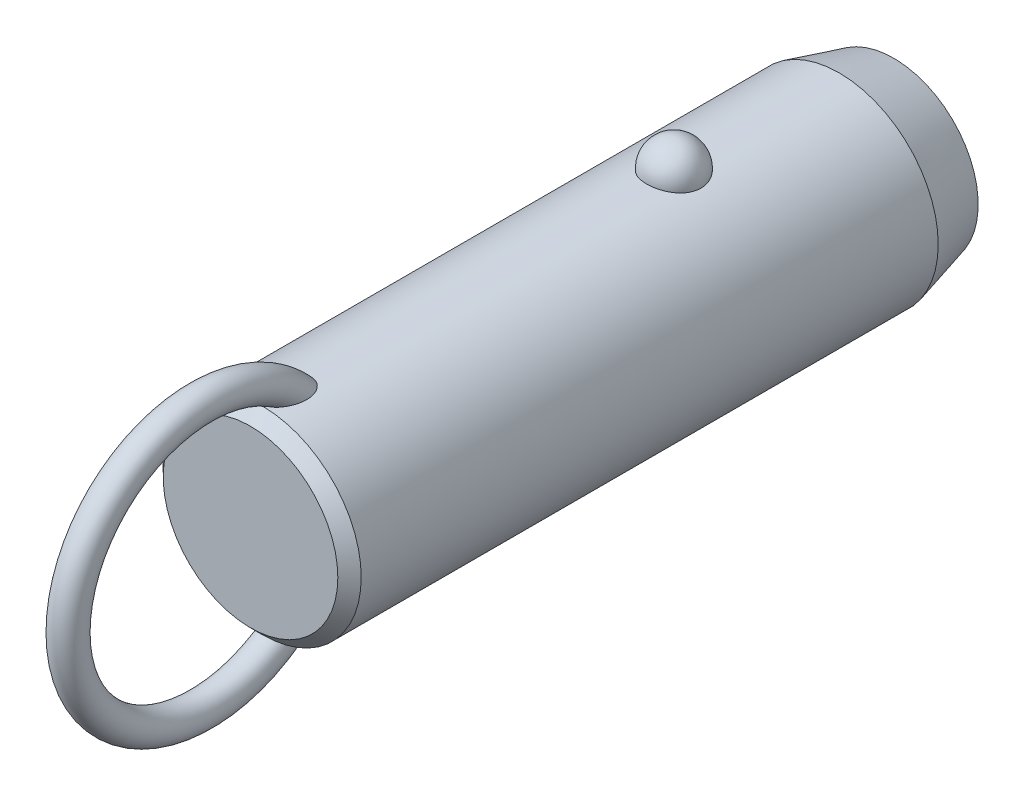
ISO-10303-21;
HEADER;
FILE_DESCRIPTION(('STEP AP214'),'2;1');
FILE_NAME('part.step','',(''),(''),'','','');
FILE_SCHEMA(('AUTOMOTIVE_DESIGN { 1 0 10303 214 1 1 1 1 }'));
ENDSEC;
DATA;
#1=APPLICATION_CONTEXT('core data for automotive mechanical design processes');
#2=APPLICATION_PROTOCOL_DEFINITION('international standard','automotive_design',2000,#1);
#3=PRODUCT_CONTEXT('',#1,'mechanical');
#4=PRODUCT('Part','Part','',(#3));
#5=PRODUCT_RELATED_PRODUCT_CATEGORY('part','',(#4));
#6=PRODUCT_DEFINITION_FORMATION('','',#4);
#7=PRODUCT_DEFINITION_CONTEXT('part definition',#1,'design');
#8=PRODUCT_DEFINITION('design','',#6,#7);
#9=PRODUCT_DEFINITION_SHAPE('','',#8);
#10=(LENGTH_UNIT() NAMED_UNIT(*) SI_UNIT(.MILLI.,.METRE.));
#11=(NAMED_UNIT(*) PLANE_ANGLE_UNIT() SI_UNIT($,.RADIAN.));
#12=(NAMED_UNIT(*) SI_UNIT($,.STERADIAN.) SOLID_ANGLE_UNIT());
#13=UNCERTAINTY_MEASURE_WITH_UNIT(LENGTH_MEASURE(1.E-05),#10,'distance_accuracy_value','');
#14=(GEOMETRIC_REPRESENTATION_CONTEXT(3) GLOBAL_UNCERTAINTY_ASSIGNED_CONTEXT((#13)) GLOBAL_UNIT_ASSIGNED_CONTEXT((#10,
#11,#12)) REPRESENTATION_CONTEXT('',''));
#15=CARTESIAN_POINT('',(0.,0.,0.));
#16=DIRECTION('',(0.,0.,1.));
#17=DIRECTION('',(1.,0.,0.));
#18=AXIS2_PLACEMENT_3D('',#15,#16,#17);
#19=CARTESIAN_POINT('',(0.,0.,38.1));
#20=DIRECTION('',(0.,0.,-1.));
#21=DIRECTION('',(-1.,0.,0.));
#22=AXIS2_PLACEMENT_3D('',#19,#20,#21);
#23=CYLINDRICAL_SURFACE('',#22,12.7);
#24=CARTESIAN_POINT('',(3.46661256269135,12.2177165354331,-3.5));
#25=CARTESIAN_POINT('',(3.4666090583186,12.2177194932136,-3.30432790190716));
#26=CARTESIAN_POINT('',(3.45063567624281,12.2222841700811,-3.10861112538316));
#27=CARTESIAN_POINT('',(3.38712451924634,12.2400345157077,-2.72271899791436));
#28=CARTESIAN_POINT('',(3.33957415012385,12.2532236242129,-2.53254588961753));
#29=CARTESIAN_POINT('',(3.2141234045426,12.286724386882,-2.16324948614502));
#30=CARTESIAN_POINT('',(3.13623639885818,12.3070329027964,-1.98412136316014));
#31=CARTESIAN_POINT('',(2.95205930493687,12.3525018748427,-1.64180592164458));
#32=CARTESIAN_POINT('',(2.84577003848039,12.3776621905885,-1.47861814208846));
#33=CARTESIAN_POINT('',(2.60688050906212,12.4301712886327,-1.17190583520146));
#34=CARTESIAN_POINT('',(2.47415697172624,12.4575299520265,-1.02847897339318));
#35=CARTESIAN_POINT('',(2.18615174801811,12.5112810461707,-0.766177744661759));
#36=CARTESIAN_POINT('',(2.03087002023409,12.5376734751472,-0.647303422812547));
#37=CARTESIAN_POINT('',(1.70237334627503,12.5864761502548,-0.437732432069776));
#38=CARTESIAN_POINT('',(1.52920948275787,12.6088972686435,-0.346958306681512));
#39=CARTESIAN_POINT('',(1.16944170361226,12.6473352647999,-0.195750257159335));
#40=CARTESIAN_POINT('',(0.982839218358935,12.663352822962,-0.135313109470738));
#41=CARTESIAN_POINT('',(0.604961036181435,12.6869706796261,-0.0473241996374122));
#42=CARTESIAN_POINT('',(0.413823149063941,12.6947125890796,-0.0192185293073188));
#43=CARTESIAN_POINT('',(0.0293827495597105,12.7014203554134,0.00517254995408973));
#44=CARTESIAN_POINT('',(-0.163919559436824,12.7003870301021,0.00146092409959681));
#45=CARTESIAN_POINT('',(-0.544374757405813,12.689735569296,-0.037393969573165));
#46=CARTESIAN_POINT('',(-0.731575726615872,12.6802364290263,-0.0721015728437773));
#47=CARTESIAN_POINT('',(-1.09733277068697,12.6538333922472,-0.171364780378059));
#48=CARTESIAN_POINT('',(-1.27588869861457,12.6369293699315,-0.235920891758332));
#49=CARTESIAN_POINT('',(-1.6204698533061,12.5973946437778,-0.39354853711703));
#50=CARTESIAN_POINT('',(-1.78641865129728,12.5747321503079,-0.486778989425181));
#51=CARTESIAN_POINT('',(-2.10030671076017,12.5261316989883,-0.699110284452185));
#52=CARTESIAN_POINT('',(-2.24824419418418,12.5001934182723,-0.81821367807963));
#53=CARTESIAN_POINT('',(-2.52491489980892,12.4472906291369,-1.08157124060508));
#54=CARTESIAN_POINT('',(-2.65324222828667,12.4203160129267,-1.22624992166));
#55=CARTESIAN_POINT('',(-2.88410007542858,12.3687509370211,-1.53528325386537));
#56=CARTESIAN_POINT('',(-2.98662883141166,12.3441606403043,-1.69963924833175));
#57=CARTESIAN_POINT('',(-3.16432417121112,12.2998199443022,-2.04548497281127));
#58=CARTESIAN_POINT('',(-3.23917525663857,12.2801261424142,-2.22714424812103));
#59=CARTESIAN_POINT('',(-3.35800573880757,12.248167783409,-2.6009138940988));
#60=CARTESIAN_POINT('',(-3.4019860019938,12.2359030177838,-2.79302397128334));
#61=CARTESIAN_POINT('',(-3.45784812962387,12.2202347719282,-3.18140279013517));
#62=CARTESIAN_POINT('',(-3.46986123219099,12.2167950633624,-3.37765118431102));
#63=CARTESIAN_POINT('',(-3.46186273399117,12.2190638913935,-3.76943689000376));
#64=CARTESIAN_POINT('',(-3.44185196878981,12.2247721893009,-3.96497421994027));
#65=CARTESIAN_POINT('',(-3.37048652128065,12.2446381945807,-4.34881728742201));
#66=CARTESIAN_POINT('',(-3.31928253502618,12.2587552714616,-4.53715319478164));
#67=CARTESIAN_POINT('',(-3.18693461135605,12.2938237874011,-4.90231727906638));
#68=CARTESIAN_POINT('',(-3.1057895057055,12.3147754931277,-5.07914500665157));
#69=CARTESIAN_POINT('',(-2.91506431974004,12.3613125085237,-5.41732059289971));
#70=CARTESIAN_POINT('',(-2.80533587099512,12.3869217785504,-5.57858147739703));
#71=CARTESIAN_POINT('',(-2.560414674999,12.4398525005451,-5.88013283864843));
#72=CARTESIAN_POINT('',(-2.42522099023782,12.4671740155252,-6.02042254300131));
#73=CARTESIAN_POINT('',(-2.1323357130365,12.5205965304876,-6.27662798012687));
#74=CARTESIAN_POINT('',(-1.97456596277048,12.5466928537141,-6.39245542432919));
#75=CARTESIAN_POINT('',(-1.64115839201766,12.5946384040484,-6.59583547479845));
#76=CARTESIAN_POINT('',(-1.46552179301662,12.6164879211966,-6.68339001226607));
#77=CARTESIAN_POINT('',(-1.10356050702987,12.6532533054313,-6.82682153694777));
#78=CARTESIAN_POINT('',(-0.917391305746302,12.6682500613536,-6.88306988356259));
#79=CARTESIAN_POINT('',(-0.537836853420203,12.6900288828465,-6.96386887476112));
#80=CARTESIAN_POINT('',(-0.344452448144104,12.6968119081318,-6.9884232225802));
#81=CARTESIAN_POINT('',(0.0402577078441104,12.7013667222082,-7.00496469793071));
#82=CARTESIAN_POINT('',(0.231556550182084,12.6993008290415,-6.99753844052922));
#83=CARTESIAN_POINT('',(0.610105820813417,12.6867505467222,-6.95166366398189));
#84=CARTESIAN_POINT('',(0.797356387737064,12.6762664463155,-6.91321620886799));
#85=CARTESIAN_POINT('',(1.16186657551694,12.6480587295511,-6.80658431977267));
#86=CARTESIAN_POINT('',(1.33915951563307,12.6303611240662,-6.73850666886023));
#87=CARTESIAN_POINT('',(1.67968518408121,12.5896027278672,-6.57450875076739));
#88=CARTESIAN_POINT('',(1.84291705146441,12.5665416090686,-6.47858678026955));
#89=CARTESIAN_POINT('',(2.15340192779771,12.5171072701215,-6.25982455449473));
#90=CARTESIAN_POINT('',(2.30037831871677,12.4906895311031,-6.13660186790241));
#91=CARTESIAN_POINT('',(2.5717412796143,12.4376567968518,-5.86739587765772));
#92=CARTESIAN_POINT('',(2.69612388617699,12.4110417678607,-5.72140858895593));
#93=CARTESIAN_POINT('',(2.92107785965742,12.360051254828,-5.40794137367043));
#94=CARTESIAN_POINT('',(3.02121329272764,12.3357209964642,-5.24014110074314));
#95=CARTESIAN_POINT('',(3.19236291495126,12.2925446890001,-4.8896986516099));
#96=CARTESIAN_POINT('',(3.26338839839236,12.2736965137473,-4.70706226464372));
#97=CARTESIAN_POINT('',(3.36788038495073,12.245404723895,-4.35469510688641));
#98=CARTESIAN_POINT('',(3.40484026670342,12.2351018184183,-4.18605935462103));
#99=CARTESIAN_POINT('',(3.45420764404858,12.2212564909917,-3.84496058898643));
#100=CARTESIAN_POINT('',(3.46661565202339,12.2177139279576,-3.67249765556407));
#101=CARTESIAN_POINT('',(3.46661256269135,12.2177165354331,-3.5));
#102=B_SPLINE_CURVE_WITH_KNOTS('',3,(#24,#25,#26,#27,#28,#29,#30,#31,#32,#33,#34,#35,#36,#37,
#38,#39,#40,#41,#42,#43,#44,#45,#46,#47,#48,#49,#50,#51,#52,#53,#54,#55,#56,#57,#58,#59,#60,#61,
#62,#63,#64,#65,#66,#67,#68,#69,#70,#71,#72,#73,#74,#75,#76,#77,#78,#79,#80,#81,#82,#83,#84,#85,
#86,#87,#88,#89,#90,#91,#92,#93,#94,#95,#96,#97,#98,#99,#100,#101),.UNSPECIFIED.,.T.,.F.,(4,2,2,
2,2,2,2,2,2,2,2,2,2,2,2,2,2,2,2,2,2,2,2,2,2,2,2,2,2,2,2,2,2,2,2,2,2,2,4),(0.,0.586396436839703,
1.17302689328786,1.7593990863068,2.34575431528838,2.93491084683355,3.52406845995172,
4.11158733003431,4.69904375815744,5.2762784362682,5.85345931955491,6.42265312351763,
6.99185659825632,7.56427334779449,8.136746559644,8.71981013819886,9.3029135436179,
9.89247258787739,10.4820150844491,11.0691335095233,11.6562366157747,12.2405256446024,
12.8248374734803,13.412244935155,13.9996740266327,14.5891883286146,15.1786623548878,
15.7609861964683,16.3432419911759,16.914863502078,17.4864654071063,18.0560241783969,
18.6256177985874,19.2037609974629,19.7820055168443,20.3699810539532,20.9577282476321,
21.4746855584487,21.9916320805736),.UNSPECIFIED.);
#103=CARTESIAN_POINT('',(3.46661256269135,12.2177165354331,-3.5));
#104=VERTEX_POINT('',#103);
#105=EDGE_CURVE('E41',#104,#104,#102,.T.);
#106=ORIENTED_EDGE('',*,*,#105,.T.);
#107=EDGE_LOOP('',(#106));
#108=FACE_BOUND('',#107,.T.);
#109=CARTESIAN_POINT('',(0.,0.,49.3000000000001));
#110=DIRECTION('',(0.,0.,1.));
#111=DIRECTION('',(1.,0.,0.));
#112=AXIS2_PLACEMENT_3D('',#109,#110,#111);
#113=CIRCLE('',#112,12.7);
#114=CARTESIAN_POINT('',(12.7,0.,49.3000000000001));
#115=VERTEX_POINT('',#114);
#116=EDGE_CURVE('E10',#115,#115,#113,.F.);
#117=ORIENTED_EDGE('',*,*,#116,.T.);
#118=EDGE_LOOP('',(#117));
#119=FACE_BOUND('',#118,.T.);
#120=CARTESIAN_POINT('',(-0.548122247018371,-12.6881662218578,43.0432187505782));
#121=CARTESIAN_POINT('',(-0.648865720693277,-12.6838128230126,43.077926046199));
#122=CARTESIAN_POINT('',(-0.746398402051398,-12.6783867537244,43.1220428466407));
#123=CARTESIAN_POINT('',(-0.932125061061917,-12.666091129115,43.2267647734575));
#124=CARTESIAN_POINT('',(-1.02030388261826,-12.6592192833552,43.287396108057));
#125=CARTESIAN_POINT('',(-1.18487740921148,-12.6448747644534,43.421847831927));
#126=CARTESIAN_POINT('',(-1.26134296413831,-12.637406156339,43.4955825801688));
#127=CARTESIAN_POINT('',(-1.4023120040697,-12.6225412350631,43.6536045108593));
#128=CARTESIAN_POINT('',(-1.46681470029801,-12.6151449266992,43.7378923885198));
#129=CARTESIAN_POINT('',(-1.60714786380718,-12.5981718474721,43.9496577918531));
#130=CARTESIAN_POINT('',(-1.67725126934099,-12.588900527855,44.080962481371));
#131=CARTESIAN_POINT('',(-1.79536591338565,-12.5725964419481,44.3532471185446));
#132=CARTESIAN_POINT('',(-1.84333535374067,-12.5655679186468,44.4942447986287));
#133=CARTESIAN_POINT('',(-1.93422576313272,-12.5519624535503,44.8376455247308));
#134=CARTESIAN_POINT('',(-1.96788773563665,-12.5466298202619,45.0425578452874));
#135=CARTESIAN_POINT('',(-1.9941399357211,-12.542463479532,45.3517600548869));
#136=CARTESIAN_POINT('',(-1.99883864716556,-12.5417153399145,45.4552987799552));
#137=CARTESIAN_POINT('',(-2.00078003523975,-12.5414074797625,45.6624512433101));
#138=CARTESIAN_POINT('',(-1.99802449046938,-12.5418474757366,45.7660649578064));
#139=CARTESIAN_POINT('',(-1.98336733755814,-12.5441750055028,46.0103207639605));
#140=CARTESIAN_POINT('',(-1.96851430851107,-12.5465291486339,46.1507804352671));
#141=CARTESIAN_POINT('',(-1.92707089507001,-12.5529612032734,46.4299607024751));
#142=CARTESIAN_POINT('',(-1.90047458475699,-12.5570399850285,46.5686803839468));
#143=CARTESIAN_POINT('',(-1.8361912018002,-12.5666008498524,46.8434113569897));
#144=CARTESIAN_POINT('',(-1.79850828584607,-12.57208240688,46.9794236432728));
#145=CARTESIAN_POINT('',(-1.71223796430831,-12.5841228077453,47.2478421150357));
#146=CARTESIAN_POINT('',(-1.66365679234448,-12.5906810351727,47.3802503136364));
#147=CARTESIAN_POINT('',(-1.5780450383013,-12.6016176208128,47.5854887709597));
#148=CARTESIAN_POINT('',(-1.54477252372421,-12.6057501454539,47.6599149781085));
#149=CARTESIAN_POINT('',(-1.47424480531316,-12.6141930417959,47.8068393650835));
#150=CARTESIAN_POINT('',(-1.436990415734,-12.6185033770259,47.8793379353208));
#151=CARTESIAN_POINT('',(-1.35825795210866,-12.6272207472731,48.0218926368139));
#152=CARTESIAN_POINT('',(-1.31678520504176,-12.6316276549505,48.0919517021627));
#153=CARTESIAN_POINT('',(-1.22917793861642,-12.6404532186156,48.2290705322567));
#154=CARTESIAN_POINT('',(-1.18304514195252,-12.6448718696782,48.2961313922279));
#155=CARTESIAN_POINT('',(-1.07246411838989,-12.6547893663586,48.4438741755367));
#156=CARTESIAN_POINT('',(-1.00642239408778,-12.6602600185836,48.5233844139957));
#157=CARTESIAN_POINT('',(-0.864441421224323,-12.6707460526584,48.6731698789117));
#158=CARTESIAN_POINT('',(-0.788516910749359,-12.6757620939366,48.7434585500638));
#159=CARTESIAN_POINT('',(-0.652215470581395,-12.6833591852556,48.8486801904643));
#160=CARTESIAN_POINT('',(-0.594982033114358,-12.6861973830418,48.8876241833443));
#161=CARTESIAN_POINT('',(-0.475269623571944,-12.6912445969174,48.9564899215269));
#162=CARTESIAN_POINT('',(-0.412800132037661,-12.6934547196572,48.9864275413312));
#163=CARTESIAN_POINT('',(-0.295749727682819,-12.6966636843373,49.0297565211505));
#164=CARTESIAN_POINT('',(-0.241949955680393,-12.6978134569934,49.0452188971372));
#165=CARTESIAN_POINT('',(-0.132508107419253,-12.6994261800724,49.0668845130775));
#166=CARTESIAN_POINT('',(-0.0768679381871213,-12.6998898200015,49.0730970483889));
#167=CARTESIAN_POINT('',(0.034769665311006,-12.7000752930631,49.0755838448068));
#168=CARTESIAN_POINT('',(0.0907676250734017,-12.6997954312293,49.0718353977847));
#169=CARTESIAN_POINT('',(0.201283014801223,-12.6985255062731,49.0547883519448));
#170=CARTESIAN_POINT('',(0.255799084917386,-12.6975348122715,49.0414812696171));
#171=CARTESIAN_POINT('',(0.376042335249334,-12.6946091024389,49.0020379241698));
#172=CARTESIAN_POINT('',(0.44095085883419,-12.6924943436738,48.9734492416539));
#173=CARTESIAN_POINT('',(0.565350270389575,-12.6875639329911,48.9063234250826));
#174=CARTESIAN_POINT('',(0.624828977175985,-12.6847467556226,48.8677646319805));
#175=CARTESIAN_POINT('',(0.774116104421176,-12.6767252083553,48.756949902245));
#176=CARTESIAN_POINT('',(0.859449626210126,-12.6711344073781,48.6787605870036));
#177=CARTESIAN_POINT('',(1.01789440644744,-12.6593922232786,48.510943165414));
#178=CARTESIAN_POINT('',(1.09096902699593,-12.653239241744,48.421282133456));
#179=CARTESIAN_POINT('',(1.22268793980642,-12.6411674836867,48.2402658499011));
#180=CARTESIAN_POINT('',(1.28193986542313,-12.6352572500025,48.149345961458));
#181=CARTESIAN_POINT('',(1.39259777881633,-12.6235401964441,47.9627929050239));
#182=CARTESIAN_POINT('',(1.44399707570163,-12.6177334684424,47.8671558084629));
#183=CARTESIAN_POINT('',(1.53972870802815,-12.6064093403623,47.6722738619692));
#184=CARTESIAN_POINT('',(1.58405262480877,-12.6008922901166,47.5730248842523));
#185=CARTESIAN_POINT('',(1.66600705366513,-12.5903187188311,47.3717727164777));
#186=CARTESIAN_POINT('',(1.70363651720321,-12.5852622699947,47.2697690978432));
#187=CARTESIAN_POINT('',(1.77545379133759,-12.5753406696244,47.0543580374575));
#188=CARTESIAN_POINT('',(1.80903453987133,-12.5705328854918,46.940745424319));
#189=CARTESIAN_POINT('',(1.86844163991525,-12.5618400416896,46.7114575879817));
#190=CARTESIAN_POINT('',(1.89426665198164,-12.5579551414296,46.5957820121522));
#191=CARTESIAN_POINT('',(1.9378546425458,-12.5513030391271,46.3630072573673));
#192=CARTESIAN_POINT('',(1.95562640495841,-12.5485346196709,46.2459097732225));
#193=CARTESIAN_POINT('',(1.98264463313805,-12.5442934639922,46.0107473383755));
#194=CARTESIAN_POINT('',(1.99189298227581,-12.5428204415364,45.8926826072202));
#195=CARTESIAN_POINT('',(2.00416068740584,-12.540871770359,45.5806225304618));
#196=CARTESIAN_POINT('',(1.99944433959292,-12.541631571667,45.3862290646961));
#197=CARTESIAN_POINT('',(1.96113755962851,-12.5476846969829,45.0003095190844));
#198=CARTESIAN_POINT('',(1.92758341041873,-12.5529723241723,44.8087801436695));
#199=CARTESIAN_POINT('',(1.8393434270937,-12.5661532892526,44.4822728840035));
#200=CARTESIAN_POINT('',(1.79215440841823,-12.5730485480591,44.3452499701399));
#201=CARTESIAN_POINT('',(1.67676242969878,-12.588958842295,44.0804459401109));
#202=CARTESIAN_POINT('',(1.60859050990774,-12.597970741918,43.9526515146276));
#203=CARTESIAN_POINT('',(1.46583832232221,-12.6152829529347,43.7358006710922));
#204=CARTESIAN_POINT('',(1.39525727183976,-12.6233659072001,43.6441050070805));
#205=CARTESIAN_POINT('',(1.23992594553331,-12.6395676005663,43.4734854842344));
#206=CARTESIAN_POINT('',(1.15517932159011,-12.6476863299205,43.3945583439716));
#207=CARTESIAN_POINT('',(0.97199516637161,-12.6630846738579,43.2526438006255));
#208=CARTESIAN_POINT('',(0.873456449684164,-12.6703572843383,43.1897849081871));
#209=CARTESIAN_POINT('',(0.665847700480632,-12.6829569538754,43.0844870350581));
#210=CARTESIAN_POINT('',(0.556784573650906,-12.688285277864,43.0420347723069));
#211=CARTESIAN_POINT('',(0.347338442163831,-12.6956226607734,42.9844434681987));
#212=CARTESIAN_POINT('',(0.24775974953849,-12.6979816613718,42.9663996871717));
#213=CARTESIAN_POINT('',(0.0470218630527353,-12.7003077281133,42.9486007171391));
#214=CARTESIAN_POINT('',(-0.0541350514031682,-12.7002779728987,42.9488212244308));
#215=CARTESIAN_POINT('',(-0.221414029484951,-12.6982482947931,42.9643639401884));
#216=CARTESIAN_POINT('',(-0.288055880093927,-12.6969033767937,42.9746662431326));
#217=CARTESIAN_POINT('',(-0.41959929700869,-12.6932369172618,43.0031348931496));
#218=CARTESIAN_POINT('',(-0.484501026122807,-12.6909154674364,43.0213005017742));
#219=CARTESIAN_POINT('',(-0.548122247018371,-12.6881662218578,43.0432187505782));
#220=B_SPLINE_CURVE_WITH_KNOTS('',3,(#120,#121,#122,#123,#124,#125,#126,#127,#128,#129,#130,
#131,#132,#133,#134,#135,#136,#137,#138,#139,#140,#141,#142,#143,#144,#145,#146,#147,#148,#149,
#150,#151,#152,#153,#154,#155,#156,#157,#158,#159,#160,#161,#162,#163,#164,#165,#166,#167,#168,
#169,#170,#171,#172,#173,#174,#175,#176,#177,#178,#179,#180,#181,#182,#183,#184,#185,#186,#187,
#188,#189,#190,#191,#192,#193,#194,#195,#196,#197,#198,#199,#200,#201,#202,#203,#204,#205,#206,
#207,#208,#209,#210,#211,#212,#213,#214,#215,#216,#217,#218,#219),.UNSPECIFIED.,.T.,.F.,(4,2,2,
2,2,2,2,2,2,2,2,2,2,2,2,2,2,2,2,2,2,2,2,2,2,2,2,2,2,2,2,2,2,2,2,2,2,2,2,2,2,2,2,2,2,2,2,2,2,4),
(0.,0.319642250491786,0.63979475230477,0.957927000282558,1.27608021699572,1.72100165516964,
2.16675988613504,2.78630021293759,3.09705782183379,3.40774128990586,3.83096358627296,
4.25439969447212,4.67767724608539,5.10071330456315,5.3455029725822,5.59024267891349,
5.8346770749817,6.07902143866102,6.38891080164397,6.69834321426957,6.90560910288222,
7.11250749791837,7.27977315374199,7.44687060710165,7.61434932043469,7.78197685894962,
7.99365544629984,8.20579780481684,8.55147335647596,8.89816429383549,9.22375138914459,
9.54961437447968,9.87586224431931,10.202161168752,10.557587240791,10.9130746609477,
11.2681734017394,11.6231936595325,12.2046601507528,12.7853961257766,13.219164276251,
13.6522938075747,13.9989174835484,14.3454519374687,14.6946768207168,15.0436740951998,
15.3457513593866,15.6474266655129,15.8493051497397,16.0511646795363),.UNSPECIFIED.);
#221=CARTESIAN_POINT('',(-0.548122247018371,-12.6881662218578,43.0432187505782));
#222=VERTEX_POINT('',#221);
#223=EDGE_CURVE('E60',#222,#222,#220,.T.);
#224=ORIENTED_EDGE('',*,*,#223,.T.);
#225=EDGE_LOOP('',(#224));
#226=FACE_BOUND('',#225,.T.);
#227=CARTESIAN_POINT('',(-0.548122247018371,12.6881662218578,43.0432187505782));
#228=CARTESIAN_POINT('',(-0.459436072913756,12.6919968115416,43.012673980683));
#229=CARTESIAN_POINT('',(-0.368189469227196,12.6949996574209,42.9893913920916));
#230=CARTESIAN_POINT('',(-0.183024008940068,12.6990186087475,42.9584062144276));
#231=CARTESIAN_POINT('',(-0.0891049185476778,12.7000345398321,42.9507049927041));
#232=CARTESIAN_POINT('',(0.0987147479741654,12.6999636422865,42.9512455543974));
#233=CARTESIAN_POINT('',(0.1926153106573,12.6988761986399,42.959492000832));
#234=CARTESIAN_POINT('',(0.377658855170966,12.6947211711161,42.9915515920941));
#235=CARTESIAN_POINT('',(0.468801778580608,12.6916535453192,43.0153650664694));
#236=CARTESIAN_POINT('',(0.645809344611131,12.6838788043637,43.0774565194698));
#237=CARTESIAN_POINT('',(0.731679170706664,12.6791733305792,43.115720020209));
#238=CARTESIAN_POINT('',(0.896315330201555,12.6686004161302,43.205120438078));
#239=CARTESIAN_POINT('',(0.975080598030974,12.6627328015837,43.2562592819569));
#240=CARTESIAN_POINT('',(1.12963655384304,12.6499161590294,43.3736782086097));
#241=CARTESIAN_POINT('',(1.20478673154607,12.6429194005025,43.4407929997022));
#242=CARTESIAN_POINT('',(1.34448241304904,12.6288282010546,43.5852250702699));
#243=CARTESIAN_POINT('',(1.40902173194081,12.621733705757,43.6625482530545));
#244=CARTESIAN_POINT('',(1.55208211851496,12.6050877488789,43.8592475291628));
#245=CARTESIAN_POINT('',(1.62510490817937,12.5957546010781,43.9826540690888));
#246=CARTESIAN_POINT('',(1.75019044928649,12.5789823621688,44.2397690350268));
#247=CARTESIAN_POINT('',(1.8022137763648,12.5715468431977,44.373496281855));
#248=CARTESIAN_POINT('',(1.90309965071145,12.5567434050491,44.6983516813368));
#249=CARTESIAN_POINT('',(1.94342317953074,12.5504515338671,44.8921611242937));
#250=CARTESIAN_POINT('',(1.99332997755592,12.5426147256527,45.2837881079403));
#251=CARTESIAN_POINT('',(2.00285305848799,12.5410790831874,45.481612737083));
#252=CARTESIAN_POINT('',(1.99678999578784,12.5420407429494,45.8166427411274));
#253=CARTESIAN_POINT('',(1.98794117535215,12.5434564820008,45.9540428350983));
#254=CARTESIAN_POINT('',(1.95865119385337,12.5480641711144,46.2276394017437));
#255=CARTESIAN_POINT('',(1.93820436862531,12.5512569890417,46.3638352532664));
#256=CARTESIAN_POINT('',(1.88647896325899,12.5591352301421,46.6342493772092));
#257=CARTESIAN_POINT('',(1.85518800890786,12.5638223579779,46.7684652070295));
#258=CARTESIAN_POINT('',(1.78217886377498,12.5743868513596,47.0339362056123));
#259=CARTESIAN_POINT('',(1.74046509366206,12.5802637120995,47.1651926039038));
#260=CARTESIAN_POINT('',(1.66024095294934,12.5910571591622,47.3860855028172));
#261=CARTESIAN_POINT('',(1.62434772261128,12.5957535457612,47.4766904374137));
#262=CARTESIAN_POINT('',(1.54709009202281,12.6054762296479,47.6555125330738));
#263=CARTESIAN_POINT('',(1.50572681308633,12.6105024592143,47.7437301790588));
#264=CARTESIAN_POINT('',(1.41728020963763,12.620748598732,47.9169321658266));
#265=CARTESIAN_POINT('',(1.37021377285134,12.625967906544,48.0019251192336));
#266=CARTESIAN_POINT('',(1.26969620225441,12.6364721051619,48.1680072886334));
#267=CARTESIAN_POINT('',(1.21624929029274,12.6417569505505,48.2490990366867));
#268=CARTESIAN_POINT('',(1.10304413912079,12.6521331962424,48.4047027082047));
#269=CARTESIAN_POINT('',(1.04340936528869,12.657226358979,48.4793033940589));
#270=CARTESIAN_POINT('',(0.915919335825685,12.6670906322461,48.621324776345));
#271=CARTESIAN_POINT('',(0.84806456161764,12.6718617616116,48.6887458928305));
#272=CARTESIAN_POINT('',(0.717035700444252,12.67987711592,48.8006247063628));
#273=CARTESIAN_POINT('',(0.655526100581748,12.6832377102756,48.8469970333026));
#274=CARTESIAN_POINT('',(0.525985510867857,12.6892676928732,48.9296195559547));
#275=CARTESIAN_POINT('',(0.457969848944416,12.6919386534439,48.9658927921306));
#276=CARTESIAN_POINT('',(0.334859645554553,12.695691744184,49.0166572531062));
#277=CARTESIAN_POINT('',(0.281116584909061,12.6970073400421,49.0343733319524));
#278=CARTESIAN_POINT('',(0.171425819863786,12.6989609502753,49.0606429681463));
#279=CARTESIAN_POINT('',(0.115480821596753,12.699599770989,49.0692074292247));
#280=CARTESIAN_POINT('',(0.00272618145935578,12.7001251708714,49.0762531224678));
#281=CARTESIAN_POINT('',(-0.0540859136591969,12.7000089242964,49.0746964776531));
#282=CARTESIAN_POINT('',(-0.166544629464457,12.6990328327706,49.0616005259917));
#283=CARTESIAN_POINT('',(-0.222190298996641,12.6981724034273,49.0500533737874));
#284=CARTESIAN_POINT('',(-0.342018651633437,12.695562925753,49.0149128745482));
#285=CARTESIAN_POINT('',(-0.405606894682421,12.6936676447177,48.9893322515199));
#286=CARTESIAN_POINT('',(-0.5278154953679,12.6891754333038,48.9283111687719));
#287=CARTESIAN_POINT('',(-0.586425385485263,12.6865770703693,48.8928505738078));
#288=CARTESIAN_POINT('',(-0.731842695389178,12.6792129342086,48.7914960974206));
#289=CARTESIAN_POINT('',(-0.814709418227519,12.6740767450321,48.7200395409));
#290=CARTESIAN_POINT('',(-0.969101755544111,12.6632083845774,48.5658900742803));
#291=CARTESIAN_POINT('',(-1.04059564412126,12.6574746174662,48.4831668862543));
#292=CARTESIAN_POINT('',(-1.1698111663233,12.6461638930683,48.3158096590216));
#293=CARTESIAN_POINT('',(-1.22811369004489,12.6405994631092,48.2316166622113));
#294=CARTESIAN_POINT('',(-1.33743405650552,12.6295007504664,48.0585791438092));
#295=CARTESIAN_POINT('',(-1.38844577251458,12.6239664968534,47.9697307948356));
#296=CARTESIAN_POINT('',(-1.48400702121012,12.6130898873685,47.7883895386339));
#297=CARTESIAN_POINT('',(-1.52854232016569,12.6077479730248,47.6958891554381));
#298=CARTESIAN_POINT('',(-1.61150113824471,12.5974127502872,47.5081607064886));
#299=CARTESIAN_POINT('',(-1.64992317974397,12.5924195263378,47.4129319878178));
#300=CARTESIAN_POINT('',(-1.73468589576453,12.581070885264,47.1828936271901));
#301=CARTESIAN_POINT('',(-1.77831261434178,12.5749388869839,47.0470661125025));
#302=CARTESIAN_POINT('',(-1.85439734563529,12.5639437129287,46.7722128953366));
#303=CARTESIAN_POINT('',(-1.88684994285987,12.5590811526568,46.6331856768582));
#304=CARTESIAN_POINT('',(-1.9400848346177,12.550968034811,46.3530923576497));
#305=CARTESIAN_POINT('',(-1.96088706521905,12.5477147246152,46.2120301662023));
#306=CARTESIAN_POINT('',(-1.99000539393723,12.5431291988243,45.9286689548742));
#307=CARTESIAN_POINT('',(-1.99832911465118,12.5417958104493,45.7863707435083));
#308=CARTESIAN_POINT('',(-2.00166624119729,12.5412674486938,45.4576271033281));
#309=CARTESIAN_POINT('',(-1.99178843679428,12.5428579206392,45.271088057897));
#310=CARTESIAN_POINT('',(-1.9445518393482,12.5502731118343,44.9016240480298));
#311=CARTESIAN_POINT('',(-1.90724032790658,12.5560905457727,44.7186934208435));
#312=CARTESIAN_POINT('',(-1.81330718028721,12.5699462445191,44.4048488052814));
#313=CARTESIAN_POINT('',(-1.76338820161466,12.5771273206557,44.2719105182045));
#314=CARTESIAN_POINT('',(-1.6430501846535,12.593414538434,44.0156813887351));
#315=CARTESIAN_POINT('',(-1.57265346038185,12.6025185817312,43.892380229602));
#316=CARTESIAN_POINT('',(-1.42634956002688,12.6198178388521,43.6835648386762));
#317=CARTESIAN_POINT('',(-1.35423772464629,12.6278405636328,43.5953846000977));
#318=CARTESIAN_POINT('',(-1.19645664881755,12.6437632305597,43.4321079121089));
#319=CARTESIAN_POINT('',(-1.11080536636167,12.6516633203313,43.3569944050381));
#320=CARTESIAN_POINT('',(-0.947219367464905,12.6648319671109,43.2378114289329));
#321=CARTESIAN_POINT('',(-0.871624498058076,12.670300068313,43.1905414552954));
#322=CARTESIAN_POINT('',(-0.714161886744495,12.6801492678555,43.1077413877));
#323=CARTESIAN_POINT('',(-0.632295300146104,12.684530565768,43.0722091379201));
#324=CARTESIAN_POINT('',(-0.548122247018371,12.6881662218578,43.0432187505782));
#325=B_SPLINE_CURVE_WITH_KNOTS('',3,(#227,#228,#229,#230,#231,#232,#233,#234,#235,#236,#237,
#238,#239,#240,#241,#242,#243,#244,#245,#246,#247,#248,#249,#250,#251,#252,#253,#254,#255,#256,
#257,#258,#259,#260,#261,#262,#263,#264,#265,#266,#267,#268,#269,#270,#271,#272,#273,#274,#275,
#276,#277,#278,#279,#280,#281,#282,#283,#284,#285,#286,#287,#288,#289,#290,#291,#292,#293,#294,
#295,#296,#297,#298,#299,#300,#301,#302,#303,#304,#305,#306,#307,#308,#309,#310,#311,#312,#313,
#314,#315,#316,#317,#318,#319,#320,#321,#322,#323,#324),.UNSPECIFIED.,.T.,.F.,(4,2,2,2,2,2,2,2,
2,2,2,2,2,2,2,2,2,2,2,2,2,2,2,2,2,2,2,2,2,2,2,2,2,2,2,2,2,2,2,2,2,2,2,2,2,2,2,2,4),(0.,
0.281328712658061,0.562682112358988,0.84411779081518,1.12555942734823,1.40671982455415,
1.68792232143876,1.98972294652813,2.2916988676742,2.72039860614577,3.14989948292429,
3.74084916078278,4.33295293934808,4.74554109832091,5.158330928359,5.5715933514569,
5.98468079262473,6.27722775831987,6.56971484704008,6.86135609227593,7.15280542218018,
7.43927407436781,7.7257259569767,7.9563586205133,8.18646071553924,8.35559393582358,
8.52452541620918,8.69408946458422,8.86378678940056,9.06834348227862,9.27332014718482,
9.60010414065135,9.9277843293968,10.2350252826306,10.5425229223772,10.8506864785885,
11.1589244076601,11.5867893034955,12.0148612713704,12.4421984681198,12.8692745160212,
13.4279365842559,13.9856380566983,14.4107062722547,14.8353130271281,15.1765567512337,
15.5173516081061,15.7844129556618,16.051425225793),.UNSPECIFIED.);
#326=CARTESIAN_POINT('',(-0.548122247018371,12.6881662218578,43.0432187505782));
#327=VERTEX_POINT('',#326);
#328=EDGE_CURVE('E67',#327,#327,#325,.T.);
#329=ORIENTED_EDGE('',*,*,#328,.T.);
#330=EDGE_LOOP('',(#329));
#331=FACE_BOUND('',#330,.T.);
#332=CARTESIAN_POINT('',(0.,0.,-24.7000000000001));
#333=DIRECTION('',(0.,0.,-1.));
#334=DIRECTION('',(-1.,0.,0.));
#335=AXIS2_PLACEMENT_3D('',#332,#333,#334);
#336=CIRCLE('',#335,12.7);
#337=CARTESIAN_POINT('',(-12.7,0.,-24.7000000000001));
#338=VERTEX_POINT('',#337);
#339=EDGE_CURVE('E57',#338,#338,#336,.F.);
#340=ORIENTED_EDGE('',*,*,#339,.T.);
#341=EDGE_LOOP('',(#340));
#342=FACE_BOUND('',#341,.T.);
#343=ADVANCED_FACE('F37',(#108,#119,#226,#331,#342),#23,.T.);
#344=CARTESIAN_POINT('',(0.,0.,-31.7));
#345=DIRECTION('',(0.,0.,-1.));
#346=DIRECTION('',(-1.,0.,0.));
#347=AXIS2_PLACEMENT_3D('',#344,#345,#346);
#348=PLANE('',#347);
#349=CARTESIAN_POINT('',(0.,0.,-31.7));
#350=DIRECTION('',(0.,0.,-1.));
#351=DIRECTION('',(-1.,0.,0.));
#352=AXIS2_PLACEMENT_3D('',#349,#350,#351);
#353=CIRCLE('',#352,10.8243556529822);
#354=CARTESIAN_POINT('',(-10.8243556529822,0.,-31.7));
#355=VERTEX_POINT('',#354);
#356=EDGE_CURVE('E66',#355,#355,#353,.T.);
#357=ORIENTED_EDGE('',*,*,#356,.T.);
#358=EDGE_LOOP('',(#357));
#359=FACE_BOUND('',#358,.T.);
#360=ADVANCED_FACE('F85',(#359),#348,.T.);
#361=CARTESIAN_POINT('',(0.,0.,-31.7));
#362=DIRECTION('',(0.,0.,1.));
#363=DIRECTION('',(1.,0.,0.));
#364=AXIS2_PLACEMENT_3D('',#361,#362,#363);
#365=CONICAL_SURFACE('',#364,10.8243556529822,0.261799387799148);
#366=ORIENTED_EDGE('',*,*,#339,.F.);
#367=EDGE_LOOP('',(#366));
#368=FACE_BOUND('',#367,.T.);
#369=ORIENTED_EDGE('',*,*,#356,.F.);
#370=EDGE_LOOP('',(#369));
#371=FACE_BOUND('',#370,.T.);
#372=ADVANCED_FACE('F83',(#368,#371),#365,.T.);
#373=CARTESIAN_POINT('',(0.,0.,50.8));
#374=DIRECTION('',(0.,0.,1.));
#375=DIRECTION('',(1.,0.,0.));
#376=AXIS2_PLACEMENT_3D('',#373,#374,#375);
#377=PLANE('',#376);
#378=CARTESIAN_POINT('',(0.,0.,50.8));
#379=DIRECTION('',(0.,0.,1.));
#380=DIRECTION('',(1.,0.,0.));
#381=AXIS2_PLACEMENT_3D('',#378,#379,#380);
#382=CIRCLE('',#381,11.2000000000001);
#383=CARTESIAN_POINT('',(11.2000000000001,0.,50.8));
#384=VERTEX_POINT('',#383);
#385=EDGE_CURVE('E50',#384,#384,#382,.T.);
#386=ORIENTED_EDGE('',*,*,#385,.T.);
#387=EDGE_LOOP('',(#386));
#388=FACE_BOUND('',#387,.T.);
#389=ADVANCED_FACE('F77',(#388),#377,.T.);
#390=CARTESIAN_POINT('',(0.,0.,57.15));
#391=DIRECTION('',(1.,0.,0.));
#392=DIRECTION('',(0.,0.,-1.));
#393=AXIS2_PLACEMENT_3D('',#390,#391,#392);
#394=TOROIDAL_SURFACE('',#393,17.05,2.);
#395=ORIENTED_EDGE('',*,*,#328,.F.);
#396=EDGE_LOOP('',(#395));
#397=FACE_BOUND('',#396,.T.);
#398=ORIENTED_EDGE('',*,*,#223,.F.);
#399=EDGE_LOOP('',(#398));
#400=FACE_BOUND('',#399,.T.);
#401=ADVANCED_FACE('F73',(#397,#400),#394,.T.);
#402=CARTESIAN_POINT('',(0.,0.,50.8));
#403=DIRECTION('',(0.,0.,-1.));
#404=DIRECTION('',(-1.,0.,0.));
#405=AXIS2_PLACEMENT_3D('',#402,#403,#404);
#406=CONICAL_SURFACE('',#405,11.2000000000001,0.785398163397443);
#407=ORIENTED_EDGE('',*,*,#116,.F.);
#408=EDGE_LOOP('',(#407));
#409=FACE_BOUND('',#408,.T.);
#410=ORIENTED_EDGE('',*,*,#385,.F.);
#411=EDGE_LOOP('',(#410));
#412=FACE_BOUND('',#411,.T.);
#413=ADVANCED_FACE('F39',(#409,#412),#406,.T.);
#414=CARTESIAN_POINT('',(0.,12.7,-3.5));
#415=DIRECTION('',(0.,1.,0.));
#416=DIRECTION('',(0.,0.,-1.));
#417=AXIS2_PLACEMENT_3D('',#414,#415,#416);
#418=SPHERICAL_SURFACE('',#417,3.5);
#419=ORIENTED_EDGE('',*,*,#105,.F.);
#420=EDGE_LOOP('',(#419));
#421=FACE_BOUND('',#420,.T.);
#422=ADVANCED_FACE('F79',(#421),#418,.T.);
#423=CLOSED_SHELL('',(#343,#360,#372,#389,#401,#413,#422));
#424=MANIFOLD_SOLID_BREP('B2',#423);
#425=ADVANCED_BREP_SHAPE_REPRESENTATION('',(#18,#424),#14);
#426=SHAPE_DEFINITION_REPRESENTATION(#9,#425);
ENDSEC;
END-ISO-10303-21;
